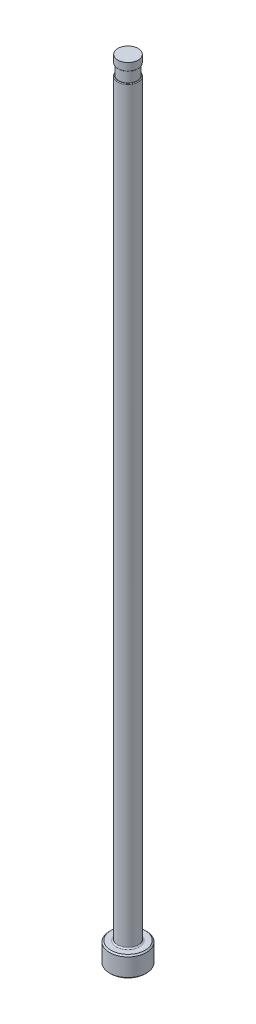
from build123d import *

# Parameters (mm, degrees)
CHAMFER1_SIZE     = 0.254
FILLET1_R         = 0.254
SKETCH2_W         = 0.2032
SKETCH2_H         = 2.032
D_SLOT_DEPTH      = 153.483544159
D_SLOT_DEPTH_BACK = 153.483544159
SKETCH5_W         = 0.0254
SKETCH5_H         = 1.524
FILLET2_R         = 0.127


with BuildPart() as part:
    # Sketch1 → Revolve1 (revolve)
    with BuildSketch(Plane.XY, mode=Mode.PRIVATE) as revolve1_sk:
        Polygon((0, 0), (-3.5687, 0), (-3.5687, 3.9624), (-1.98374, 3.9624), (-1.98374, 152.4), (0, 152.4), align=None)
    revolve(revolve1_sk.sketch.rotate(Axis((0, 259.958771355, 0), (0, -1, 0)), 270), axis=Axis((0, 259.958771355, 0), (0, -1, 0)))

    # Chamfer1
    chamfer1_edges = [part.edges().sort_by_distance(p)[0] for p in [
        (0, 3.9624, -3.5687),
        (0, 0, -3.5687),
    ]]
    chamfer(chamfer1_edges, length=CHAMFER1_SIZE)

    # Fillet1
    fillet1_edges = [part.edges().sort_by_distance(p)[0] for p in [
        (0, 3.9624, -1.98374),
    ]]
    fillet(fillet1_edges, radius=FILLET1_R)

    # Sketch2 → Vent Relief (revolve, cut)
    with BuildSketch(Plane.XY, mode=Mode.PRIVATE) as vent_relief_sk:
        with Locations((-1.88214, 149.86)):
            Rectangle(SKETCH2_W, SKETCH2_H)
    revolve(vent_relief_sk.sketch.rotate(Axis((0, 153.448281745, 0), (0, -1, 0)), 270), axis=Axis((0, 153.448281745, 0), (0, -1, 0)), mode=Mode.SUBTRACT)

    # Sketch3 → D-Slot (cut, two sides: drawn at the far end of the back side and taken through both)
    with BuildSketch(Plane.XY.offset(-D_SLOT_DEPTH_BACK)):
        with BuildLine():
            Line((-1.78054, 149.86), (-1.78054, 86.36))
            ThreePointArc((-1.78054, 86.36), (-1.831753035, 85.792038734), (-1.98374, 85.2424))
            Line((-1.98374, 85.2424), (-1.98374, 149.86))
            Line((-1.98374, 149.86), (-1.78054, 149.86))
        make_face()
    extrude(amount=D_SLOT_DEPTH + D_SLOT_DEPTH_BACK, mode=Mode.SUBTRACT)

    # Sketch5 → Vent Diameter (revolve, cut)
    with BuildSketch(Plane.XY, mode=Mode.PRIVATE) as vent_diameter_sk:
        with Locations((-1.97104, 151.638)):
            Rectangle(SKETCH5_W, SKETCH5_H)
    revolve(vent_diameter_sk.sketch.rotate(Axis((0, 152.687735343, 0), (0, -1, 0)), 90), axis=Axis((0, 152.687735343, 0), (0, -1, 0)), mode=Mode.SUBTRACT)

    # Fillet2
    fillet2_edges = [part.edges().sort_by_distance(p)[0] for p in [
        (1.683772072, 148.844, -1.04887368),
        (0, 150.876, 1.95834),
    ]]
    fillet(fillet2_edges, radius=FILLET2_R)


solid = part.part
